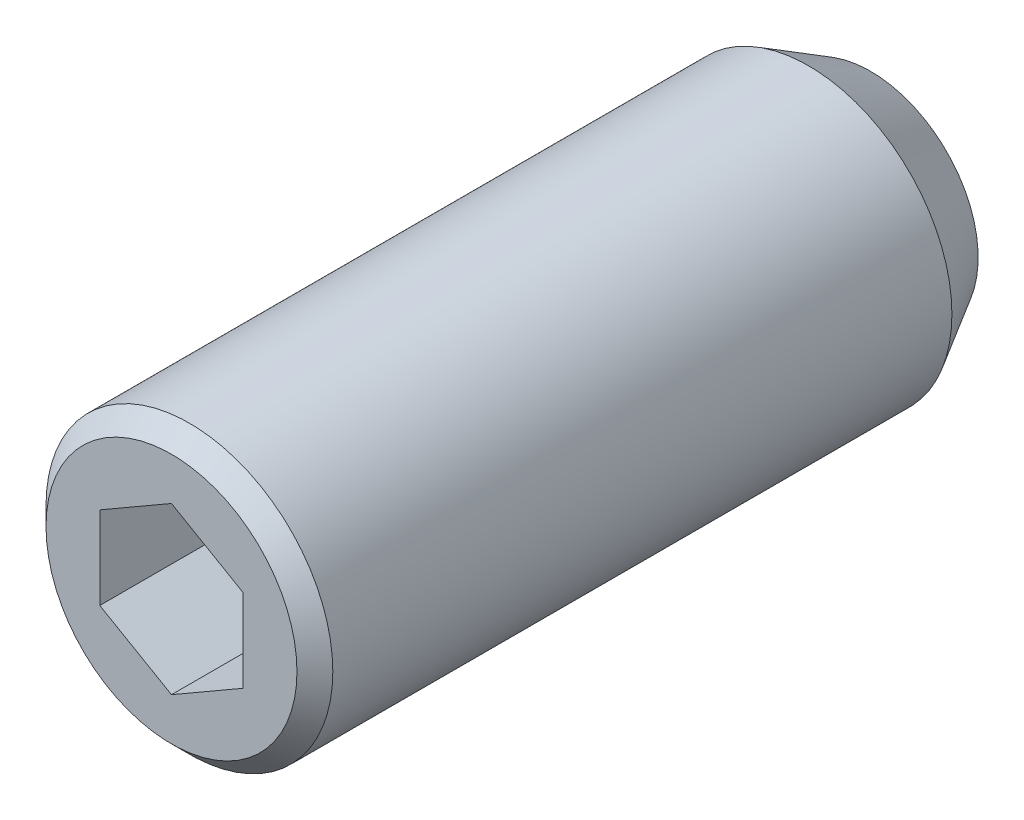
ISO-10303-21;
HEADER;
FILE_DESCRIPTION(('STEP AP214'),'2;1');
FILE_NAME('part.step','',(''),(''),'','','');
FILE_SCHEMA(('AUTOMOTIVE_DESIGN { 1 0 10303 214 1 1 1 1 }'));
ENDSEC;
DATA;
#1=APPLICATION_CONTEXT('core data for automotive mechanical design processes');
#2=APPLICATION_PROTOCOL_DEFINITION('international standard','automotive_design',2000,#1);
#3=PRODUCT_CONTEXT('',#1,'mechanical');
#4=PRODUCT('Part','Part','',(#3));
#5=PRODUCT_RELATED_PRODUCT_CATEGORY('part','',(#4));
#6=PRODUCT_DEFINITION_FORMATION('','',#4);
#7=PRODUCT_DEFINITION_CONTEXT('part definition',#1,'design');
#8=PRODUCT_DEFINITION('design','',#6,#7);
#9=PRODUCT_DEFINITION_SHAPE('','',#8);
#10=(LENGTH_UNIT() NAMED_UNIT(*) SI_UNIT(.MILLI.,.METRE.));
#11=(NAMED_UNIT(*) PLANE_ANGLE_UNIT() SI_UNIT($,.RADIAN.));
#12=(NAMED_UNIT(*) SI_UNIT($,.STERADIAN.) SOLID_ANGLE_UNIT());
#13=UNCERTAINTY_MEASURE_WITH_UNIT(LENGTH_MEASURE(1.E-05),#10,'distance_accuracy_value','');
#14=(GEOMETRIC_REPRESENTATION_CONTEXT(3) GLOBAL_UNCERTAINTY_ASSIGNED_CONTEXT((#13)) GLOBAL_UNIT_ASSIGNED_CONTEXT((#10,
#11,#12)) REPRESENTATION_CONTEXT('',''));
#15=CARTESIAN_POINT('',(0.,0.,0.));
#16=DIRECTION('',(0.,0.,1.));
#17=DIRECTION('',(1.,0.,0.));
#18=AXIS2_PLACEMENT_3D('',#15,#16,#17);
#19=CARTESIAN_POINT('',(1.,0.577350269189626,8.));
#20=DIRECTION('',(0.5,0.866025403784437,0.));
#21=DIRECTION('',(0.866025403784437,-0.5,0.));
#22=AXIS2_PLACEMENT_3D('',#19,#20,#21);
#23=PLANE('',#22);
#24=DIRECTION('',(0.,0.,1.));
#25=VECTOR('',#24,1.);
#26=CARTESIAN_POINT('',(1.,0.577350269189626,8.));
#27=LINE('',#26,#25);
#28=CARTESIAN_POINT('',(1.,0.577350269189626,8.));
#29=VERTEX_POINT('',#28);
#30=CARTESIAN_POINT('',(1.,0.577350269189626,10.));
#31=VERTEX_POINT('',#30);
#32=EDGE_CURVE('E96',#29,#31,#27,.T.);
#33=ORIENTED_EDGE('',*,*,#32,.T.);
#34=DIRECTION('',(-0.866025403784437,0.5,0.));
#35=VECTOR('',#34,1.);
#36=CARTESIAN_POINT('',(1.,0.577350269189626,10.));
#37=LINE('',#36,#35);
#38=CARTESIAN_POINT('',(0.,1.15470053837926,10.));
#39=VERTEX_POINT('',#38);
#40=EDGE_CURVE('E29',#31,#39,#37,.T.);
#41=ORIENTED_EDGE('',*,*,#40,.T.);
#42=DIRECTION('',(0.,0.,1.));
#43=VECTOR('',#42,1.);
#44=CARTESIAN_POINT('',(0.,1.15470053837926,8.));
#45=LINE('',#44,#43);
#46=CARTESIAN_POINT('',(0.,1.15470053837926,8.));
#47=VERTEX_POINT('',#46);
#48=EDGE_CURVE('E34',#47,#39,#45,.T.);
#49=ORIENTED_EDGE('',*,*,#48,.F.);
#50=DIRECTION('',(-0.866025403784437,0.5,0.));
#51=VECTOR('',#50,1.);
#52=CARTESIAN_POINT('',(1.,0.577350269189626,8.));
#53=LINE('',#52,#51);
#54=EDGE_CURVE('E90',#29,#47,#53,.T.);
#55=ORIENTED_EDGE('',*,*,#54,.F.);
#56=EDGE_LOOP('',(#33,#41,#49,#55));
#57=FACE_BOUND('',#56,.T.);
#58=ADVANCED_FACE('F14',(#57),#23,.F.);
#59=CARTESIAN_POINT('',(1.,-0.577350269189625,8.));
#60=DIRECTION('',(1.,0.,0.));
#61=DIRECTION('',(0.,-1.,0.));
#62=AXIS2_PLACEMENT_3D('',#59,#60,#61);
#63=PLANE('',#62);
#64=DIRECTION('',(0.,0.,1.));
#65=VECTOR('',#64,1.);
#66=CARTESIAN_POINT('',(1.,-0.577350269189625,8.));
#67=LINE('',#66,#65);
#68=CARTESIAN_POINT('',(1.,-0.577350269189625,8.));
#69=VERTEX_POINT('',#68);
#70=CARTESIAN_POINT('',(1.,-0.577350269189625,10.));
#71=VERTEX_POINT('',#70);
#72=EDGE_CURVE('E93',#69,#71,#67,.T.);
#73=ORIENTED_EDGE('',*,*,#72,.T.);
#74=DIRECTION('',(0.,1.,0.));
#75=VECTOR('',#74,1.);
#76=CARTESIAN_POINT('',(1.,-0.577350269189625,10.));
#77=LINE('',#76,#75);
#78=EDGE_CURVE('E117',#71,#31,#77,.T.);
#79=ORIENTED_EDGE('',*,*,#78,.T.);
#80=ORIENTED_EDGE('',*,*,#32,.F.);
#81=DIRECTION('',(0.,1.,0.));
#82=VECTOR('',#81,1.);
#83=CARTESIAN_POINT('',(1.,-0.577350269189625,8.));
#84=LINE('',#83,#82);
#85=EDGE_CURVE('E85',#69,#29,#84,.T.);
#86=ORIENTED_EDGE('',*,*,#85,.F.);
#87=EDGE_LOOP('',(#73,#79,#80,#86));
#88=FACE_BOUND('',#87,.T.);
#89=ADVANCED_FACE('F149',(#88),#63,.F.);
#90=CARTESIAN_POINT('',(1.,-0.577350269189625,8.));
#91=DIRECTION('',(-0.5,0.866025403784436,0.));
#92=DIRECTION('',(0.866025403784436,0.5,0.));
#93=AXIS2_PLACEMENT_3D('',#90,#91,#92);
#94=PLANE('',#93);
#95=DIRECTION('',(0.,0.,1.));
#96=VECTOR('',#95,1.);
#97=CARTESIAN_POINT('',(0.,-1.15470053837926,8.));
#98=LINE('',#97,#96);
#99=CARTESIAN_POINT('',(0.,-1.15470053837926,8.));
#100=VERTEX_POINT('',#99);
#101=CARTESIAN_POINT('',(0.,-1.15470053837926,10.));
#102=VERTEX_POINT('',#101);
#103=EDGE_CURVE('E68',#100,#102,#98,.T.);
#104=ORIENTED_EDGE('',*,*,#103,.T.);
#105=DIRECTION('',(-0.866025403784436,-0.5,0.));
#106=VECTOR('',#105,1.);
#107=CARTESIAN_POINT('',(1.,-0.577350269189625,10.));
#108=LINE('',#107,#106);
#109=EDGE_CURVE('E121',#71,#102,#108,.T.);
#110=ORIENTED_EDGE('',*,*,#109,.F.);
#111=ORIENTED_EDGE('',*,*,#72,.F.);
#112=DIRECTION('',(-0.866025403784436,-0.5,0.));
#113=VECTOR('',#112,1.);
#114=CARTESIAN_POINT('',(1.,-0.577350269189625,8.));
#115=LINE('',#114,#113);
#116=EDGE_CURVE('E83',#69,#100,#115,.T.);
#117=ORIENTED_EDGE('',*,*,#116,.T.);
#118=EDGE_LOOP('',(#104,#110,#111,#117));
#119=FACE_BOUND('',#118,.T.);
#120=ADVANCED_FACE('F155',(#119),#94,.T.);
#121=CARTESIAN_POINT('',(-1.,-0.577350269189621,8.));
#122=DIRECTION('',(-0.5,-0.866025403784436,0.));
#123=DIRECTION('',(-0.866025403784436,0.5,0.));
#124=AXIS2_PLACEMENT_3D('',#121,#122,#123);
#125=PLANE('',#124);
#126=DIRECTION('',(0.,0.,1.));
#127=VECTOR('',#126,1.);
#128=CARTESIAN_POINT('',(-1.,-0.577350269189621,8.));
#129=LINE('',#128,#127);
#130=CARTESIAN_POINT('',(-1.,-0.577350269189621,8.));
#131=VERTEX_POINT('',#130);
#132=CARTESIAN_POINT('',(-1.,-0.577350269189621,10.));
#133=VERTEX_POINT('',#132);
#134=EDGE_CURVE('E56',#131,#133,#129,.T.);
#135=ORIENTED_EDGE('',*,*,#134,.T.);
#136=DIRECTION('',(0.866025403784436,-0.5,0.));
#137=VECTOR('',#136,1.);
#138=CARTESIAN_POINT('',(-1.,-0.577350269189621,10.));
#139=LINE('',#138,#137);
#140=EDGE_CURVE('E130',#133,#102,#139,.T.);
#141=ORIENTED_EDGE('',*,*,#140,.T.);
#142=ORIENTED_EDGE('',*,*,#103,.F.);
#143=DIRECTION('',(0.866025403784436,-0.5,0.));
#144=VECTOR('',#143,1.);
#145=CARTESIAN_POINT('',(-1.,-0.577350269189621,8.));
#146=LINE('',#145,#144);
#147=EDGE_CURVE('E76',#131,#100,#146,.T.);
#148=ORIENTED_EDGE('',*,*,#147,.F.);
#149=EDGE_LOOP('',(#135,#141,#142,#148));
#150=FACE_BOUND('',#149,.T.);
#151=ADVANCED_FACE('F81',(#150),#125,.F.);
#152=CARTESIAN_POINT('',(-1.,-0.577350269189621,8.));
#153=DIRECTION('',(1.,0.,0.));
#154=DIRECTION('',(0.,-1.,0.));
#155=AXIS2_PLACEMENT_3D('',#152,#153,#154);
#156=PLANE('',#155);
#157=DIRECTION('',(0.,0.,1.));
#158=VECTOR('',#157,1.);
#159=CARTESIAN_POINT('',(-1.,0.577350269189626,8.));
#160=LINE('',#159,#158);
#161=CARTESIAN_POINT('',(-1.,0.577350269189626,8.));
#162=VERTEX_POINT('',#161);
#163=CARTESIAN_POINT('',(-1.,0.577350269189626,10.));
#164=VERTEX_POINT('',#163);
#165=EDGE_CURVE('E69',#162,#164,#160,.T.);
#166=ORIENTED_EDGE('',*,*,#165,.T.);
#167=DIRECTION('',(0.,1.,0.));
#168=VECTOR('',#167,1.);
#169=CARTESIAN_POINT('',(-1.,-0.577350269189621,10.));
#170=LINE('',#169,#168);
#171=EDGE_CURVE('E63',#133,#164,#170,.T.);
#172=ORIENTED_EDGE('',*,*,#171,.F.);
#173=ORIENTED_EDGE('',*,*,#134,.F.);
#174=DIRECTION('',(0.,1.,0.));
#175=VECTOR('',#174,1.);
#176=CARTESIAN_POINT('',(-1.,-0.577350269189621,8.));
#177=LINE('',#176,#175);
#178=EDGE_CURVE('E60',#131,#162,#177,.T.);
#179=ORIENTED_EDGE('',*,*,#178,.T.);
#180=EDGE_LOOP('',(#166,#172,#173,#179));
#181=FACE_BOUND('',#180,.T.);
#182=ADVANCED_FACE('F59',(#181),#156,.T.);
#183=CARTESIAN_POINT('',(-1.,0.577350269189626,8.));
#184=DIRECTION('',(0.5,-0.866025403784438,0.));
#185=DIRECTION('',(-0.866025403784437,-0.5,0.));
#186=AXIS2_PLACEMENT_3D('',#183,#184,#185);
#187=PLANE('',#186);
#188=DIRECTION('',(0.866025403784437,0.5,0.));
#189=VECTOR('',#188,1.);
#190=CARTESIAN_POINT('',(-1.,0.577350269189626,8.));
#191=LINE('',#190,#189);
#192=EDGE_CURVE('E79',#162,#47,#191,.T.);
#193=ORIENTED_EDGE('',*,*,#192,.T.);
#194=ORIENTED_EDGE('',*,*,#48,.T.);
#195=DIRECTION('',(0.866025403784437,0.5,0.));
#196=VECTOR('',#195,1.);
#197=CARTESIAN_POINT('',(-1.,0.577350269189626,10.));
#198=LINE('',#197,#196);
#199=EDGE_CURVE('E127',#164,#39,#198,.T.);
#200=ORIENTED_EDGE('',*,*,#199,.F.);
#201=ORIENTED_EDGE('',*,*,#165,.F.);
#202=EDGE_LOOP('',(#193,#194,#200,#201));
#203=FACE_BOUND('',#202,.T.);
#204=ADVANCED_FACE('F137',(#203),#187,.T.);
#205=CARTESIAN_POINT('',(2.,0.,8.));
#206=DIRECTION('',(0.,0.,1.));
#207=DIRECTION('',(-1.,0.,0.));
#208=AXIS2_PLACEMENT_3D('',#205,#206,#207);
#209=PLANE('',#208);
#210=ORIENTED_EDGE('',*,*,#54,.T.);
#211=ORIENTED_EDGE('',*,*,#192,.F.);
#212=ORIENTED_EDGE('',*,*,#178,.F.);
#213=ORIENTED_EDGE('',*,*,#147,.T.);
#214=ORIENTED_EDGE('',*,*,#116,.F.);
#215=ORIENTED_EDGE('',*,*,#85,.T.);
#216=EDGE_LOOP('',(#210,#211,#212,#213,#214,#215));
#217=FACE_BOUND('',#216,.T.);
#218=ADVANCED_FACE('F74',(#217),#209,.T.);
#219=CARTESIAN_POINT('',(0.,0.,9.75));
#220=DIRECTION('',(0.,0.,-1.));
#221=DIRECTION('',(1.,0.,0.));
#222=AXIS2_PLACEMENT_3D('',#219,#220,#221);
#223=CYLINDRICAL_SURFACE('',#222,2.);
#224=CARTESIAN_POINT('',(0.,0.,9.75));
#225=DIRECTION('',(0.,0.,-1.));
#226=DIRECTION('',(1.,0.,0.));
#227=AXIS2_PLACEMENT_3D('',#224,#225,#226);
#228=CIRCLE('',#227,2.);
#229=CARTESIAN_POINT('',(2.,0.,9.75));
#230=VERTEX_POINT('',#229);
#231=EDGE_CURVE('E101',#230,#230,#228,.T.);
#232=ORIENTED_EDGE('',*,*,#231,.T.);
#233=EDGE_LOOP('',(#232));
#234=FACE_BOUND('',#233,.T.);
#235=CARTESIAN_POINT('',(0.,0.,1.11602540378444));
#236=DIRECTION('',(0.,0.,-1.));
#237=DIRECTION('',(-1.,0.,0.));
#238=AXIS2_PLACEMENT_3D('',#235,#236,#237);
#239=CIRCLE('',#238,2.);
#240=CARTESIAN_POINT('',(-2.,0.,1.11602540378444));
#241=VERTEX_POINT('',#240);
#242=EDGE_CURVE('E118',#241,#241,#239,.T.);
#243=ORIENTED_EDGE('',*,*,#242,.F.);
#244=EDGE_LOOP('',(#243));
#245=FACE_BOUND('',#244,.T.);
#246=ADVANCED_FACE('F174',(#234,#245),#223,.T.);
#247=CARTESIAN_POINT('',(0.,0.,9.75));
#248=DIRECTION('',(0.,0.,-1.));
#249=DIRECTION('',(1.,0.,0.));
#250=AXIS2_PLACEMENT_3D('',#247,#248,#249);
#251=CONICAL_SURFACE('',#250,2.,0.785398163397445);
#252=CARTESIAN_POINT('',(0.,0.,10.));
#253=DIRECTION('',(0.,0.,-1.));
#254=DIRECTION('',(1.,0.,0.));
#255=AXIS2_PLACEMENT_3D('',#252,#253,#254);
#256=CIRCLE('',#255,1.75);
#257=CARTESIAN_POINT('',(1.75,0.,10.));
#258=VERTEX_POINT('',#257);
#259=EDGE_CURVE('E98',#258,#258,#256,.T.);
#260=ORIENTED_EDGE('',*,*,#259,.T.);
#261=EDGE_LOOP('',(#260));
#262=FACE_BOUND('',#261,.T.);
#263=ORIENTED_EDGE('',*,*,#231,.F.);
#264=EDGE_LOOP('',(#263));
#265=FACE_BOUND('',#264,.T.);
#266=ADVANCED_FACE('F182',(#262,#265),#251,.T.);
#267=CARTESIAN_POINT('',(0.,0.,10.));
#268=DIRECTION('',(0.,0.,-1.));
#269=DIRECTION('',(1.,0.,0.));
#270=AXIS2_PLACEMENT_3D('',#267,#268,#269);
#271=PLANE('',#270);
#272=ORIENTED_EDGE('',*,*,#199,.T.);
#273=ORIENTED_EDGE('',*,*,#40,.F.);
#274=ORIENTED_EDGE('',*,*,#78,.F.);
#275=ORIENTED_EDGE('',*,*,#109,.T.);
#276=ORIENTED_EDGE('',*,*,#140,.F.);
#277=ORIENTED_EDGE('',*,*,#171,.T.);
#278=EDGE_LOOP('',(#272,#273,#274,#275,#276,#277));
#279=FACE_BOUND('',#278,.T.);
#280=ORIENTED_EDGE('',*,*,#259,.F.);
#281=EDGE_LOOP('',(#280));
#282=FACE_BOUND('',#281,.T.);
#283=ADVANCED_FACE('F152',(#279,#282),#271,.F.);
#284=CARTESIAN_POINT('',(0.,0.,0.25));
#285=DIRECTION('',(0.,0.,1.));
#286=DIRECTION('',(1.,0.,0.));
#287=AXIS2_PLACEMENT_3D('',#284,#285,#286);
#288=CONICAL_SURFACE('',#287,1.5,0.523598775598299);
#289=ORIENTED_EDGE('',*,*,#242,.T.);
#290=EDGE_LOOP('',(#289));
#291=FACE_BOUND('',#290,.T.);
#292=CARTESIAN_POINT('',(0.,0.,0.25));
#293=DIRECTION('',(0.,0.,-1.));
#294=DIRECTION('',(-1.,0.,0.));
#295=AXIS2_PLACEMENT_3D('',#292,#293,#294);
#296=CIRCLE('',#295,1.5);
#297=CARTESIAN_POINT('',(-1.5,0.,0.25));
#298=VERTEX_POINT('',#297);
#299=EDGE_CURVE('E115',#298,#298,#296,.T.);
#300=ORIENTED_EDGE('',*,*,#299,.F.);
#301=EDGE_LOOP('',(#300));
#302=FACE_BOUND('',#301,.T.);
#303=ADVANCED_FACE('F196',(#291,#302),#288,.T.);
#304=CARTESIAN_POINT('',(0.,0.,0.));
#305=DIRECTION('',(0.,0.,-1.));
#306=DIRECTION('',(1.,0.,0.));
#307=AXIS2_PLACEMENT_3D('',#304,#305,#306);
#308=PLANE('',#307);
#309=CARTESIAN_POINT('',(0.,0.,0.));
#310=DIRECTION('',(0.,0.,-1.));
#311=DIRECTION('',(1.,0.,0.));
#312=AXIS2_PLACEMENT_3D('',#309,#310,#311);
#313=CIRCLE('',#312,1.);
#314=CARTESIAN_POINT('',(1.,0.,0.));
#315=VERTEX_POINT('',#314);
#316=EDGE_CURVE('E9',#315,#315,#313,.T.);
#317=ORIENTED_EDGE('',*,*,#316,.T.);
#318=EDGE_LOOP('',(#317));
#319=FACE_BOUND('',#318,.T.);
#320=ADVANCED_FACE('F16',(#319),#308,.T.);
#321=CARTESIAN_POINT('',(0.,0.,0.75));
#322=DIRECTION('',(0.,0.,-1.));
#323=DIRECTION('',(1.,0.,0.));
#324=AXIS2_PLACEMENT_3D('',#321,#322,#323);
#325=SPHERICAL_SURFACE('',#324,1.25);
#326=CARTESIAN_POINT('',(0.,0.,0.25));
#327=DIRECTION('',(0.,0.,-1.));
#328=DIRECTION('',(1.,0.,0.));
#329=AXIS2_PLACEMENT_3D('',#326,#327,#328);
#330=CIRCLE('',#329,1.14564392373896);
#331=CARTESIAN_POINT('',(1.14564392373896,0.,0.25));
#332=VERTEX_POINT('',#331);
#333=EDGE_CURVE('E22',#332,#332,#330,.T.);
#334=CARTESIAN_POINT('',(1.14564392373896,0.,0.25));
#335=CARTESIAN_POINT('',(1.14443567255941,0.,0.247231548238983));
#336=CARTESIAN_POINT('',(1.14321738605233,0.,0.244467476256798));
#337=CARTESIAN_POINT('',(1.14076080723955,0.,0.238948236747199));
#338=CARTESIAN_POINT('',(1.13952251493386,0.,0.236193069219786));
#339=CARTESIAN_POINT('',(1.13702598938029,0.,0.230691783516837));
#340=CARTESIAN_POINT('',(1.13576775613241,0.,0.227945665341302));
#341=CARTESIAN_POINT('',(1.13323141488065,0.,0.222462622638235));
#342=CARTESIAN_POINT('',(1.13195330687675,0.,0.219725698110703));
#343=CARTESIAN_POINT('',(1.12937728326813,0.,0.21426118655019));
#344=CARTESIAN_POINT('',(1.12807936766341,0.,0.21153359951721));
#345=CARTESIAN_POINT('',(1.12546379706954,0.,0.206087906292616));
#346=CARTESIAN_POINT('',(1.1241461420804,0.,0.203369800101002));
#347=CARTESIAN_POINT('',(1.12149116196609,0.,0.197943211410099));
#348=CARTESIAN_POINT('',(1.12015383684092,0.,0.195234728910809));
#349=CARTESIAN_POINT('',(1.11745958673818,0.,0.189827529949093));
#350=CARTESIAN_POINT('',(1.11610266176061,0.,0.187128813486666));
#351=CARTESIAN_POINT('',(1.11336928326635,0.,0.18174128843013));
#352=CARTESIAN_POINT('',(1.11199282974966,0.,0.179052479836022));
#353=CARTESIAN_POINT('',(1.10922046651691,0.,0.173684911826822));
#354=CARTESIAN_POINT('',(1.10782455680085,0.,0.171006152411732));
#355=CARTESIAN_POINT('',(1.10501335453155,0.,0.165658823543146));
#356=CARTESIAN_POINT('',(1.10359806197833,0.,0.16299025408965));
#357=CARTESIAN_POINT('',(1.10074816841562,0.,0.157663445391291));
#358=CARTESIAN_POINT('',(1.09931356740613,0.,0.155005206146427));
#359=CARTESIAN_POINT('',(1.09642513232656,0.,0.149699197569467));
#360=CARTESIAN_POINT('',(1.09497129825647,0.,0.14705142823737));
#361=CARTESIAN_POINT('',(1.09204447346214,0.,0.141766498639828));
#362=CARTESIAN_POINT('',(1.0905714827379,0.,0.139129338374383));
#363=CARTESIAN_POINT('',(1.08760642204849,0.,0.133865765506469));
#364=CARTESIAN_POINT('',(1.08611435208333,0.,0.131239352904));
#365=CARTESIAN_POINT('',(1.08311121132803,0.,0.125997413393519));
#366=CARTESIAN_POINT('',(1.0816001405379,0.,0.123381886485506));
#367=CARTESIAN_POINT('',(1.07855907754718,0.,0.118161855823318));
#368=CARTESIAN_POINT('',(1.0770290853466,0.,0.115557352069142));
#369=CARTESIAN_POINT('',(1.07395025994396,0.,0.110359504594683));
#370=CARTESIAN_POINT('',(1.07240142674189,0.,0.107766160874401));
#371=CARTESIAN_POINT('',(1.06928500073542,0.,0.102590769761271));
#372=CARTESIAN_POINT('',(1.06771740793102,0.,0.100008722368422));
#373=CARTESIAN_POINT('',(1.06456354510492,0.,0.0948560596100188));
#374=CARTESIAN_POINT('',(1.06297727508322,0.,0.0922854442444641));
#375=CARTESIAN_POINT('',(1.0597861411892,0.,0.0871557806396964));
#376=CARTESIAN_POINT('',(1.05818127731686,0.,0.0845967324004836));
#377=CARTESIAN_POINT('',(1.05495304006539,0.,0.0794903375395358));
#378=CARTESIAN_POINT('',(1.05332966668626,0.,0.0769429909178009));
#379=CARTESIAN_POINT('',(1.0500644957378,0.,0.071860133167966));
#380=CARTESIAN_POINT('',(1.04842269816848,0.,0.069324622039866));
#381=CARTESIAN_POINT('',(1.04512076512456,0.,0.0642655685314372));
#382=CARTESIAN_POINT('',(1.04346062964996,0.,0.0617420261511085));
#383=CARTESIAN_POINT('',(1.04012210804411,0.,0.0567070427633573));
#384=CARTESIAN_POINT('',(1.03844372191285,0.,0.0541956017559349));
#385=CARTESIAN_POINT('',(1.03506878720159,0.,0.0491849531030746));
#386=CARTESIAN_POINT('',(1.03337223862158,0.,0.0466857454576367));
#387=CARTESIAN_POINT('',(1.02996106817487,0.,0.0416996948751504));
#388=CARTESIAN_POINT('',(1.02824644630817,0.,0.039212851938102));
#389=CARTESIAN_POINT('',(1.02479921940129,0.,0.0342516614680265));
#390=CARTESIAN_POINT('',(1.02306661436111,0.,0.0317773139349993));
#391=CARTESIAN_POINT('',(1.01958351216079,0.,0.0268412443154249));
#392=CARTESIAN_POINT('',(1.01783301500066,0.,0.0243795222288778));
#393=CARTESIAN_POINT('',(1.01431422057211,0.,0.019468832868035));
#394=CARTESIAN_POINT('',(1.01254592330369,0.,0.0170198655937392));
#395=CARTESIAN_POINT('',(1.00899162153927,0.,0.012134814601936));
#396=CARTESIAN_POINT('',(1.00720561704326,0.,0.00969873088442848));
#397=CARTESIAN_POINT('',(1.00361599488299,0.,0.00483957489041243));
#398=CARTESIAN_POINT('',(1.00181237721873,0.,0.00241650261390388));
#399=CARTESIAN_POINT('',(1.,0.,0.));
#400=B_SPLINE_CURVE_WITH_KNOTS('',3,(#334,#335,#336,#337,#338,#339,#340,#341,#342,#343,#344,
#345,#346,#347,#348,#349,#350,#351,#352,#353,#354,#355,#356,#357,#358,#359,#360,#361,#362,#363,
#364,#365,#366,#367,#368,#369,#370,#371,#372,#373,#374,#375,#376,#377,#378,#379,#380,#381,#382,
#383,#384,#385,#386,#387,#388,#389,#390,#391,#392,#393,#394,#395,#396,#397,#398,#399),
.UNSPECIFIED.,.F.,.F.,(4,2,2,2,2,2,2,2,2,2,2,2,2,2,2,2,2,2,2,2,2,2,2,2,2,2,2,2,2,2,2,2,4),(0.,
0.00906186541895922,0.0181237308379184,0.0271855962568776,0.0362474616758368,0.045309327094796,
0.0543711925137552,0.0634330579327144,0.0724949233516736,0.0815567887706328,0.0906186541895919,
0.0996805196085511,0.10874238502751,0.11780425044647,0.126866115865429,0.135927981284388,
0.144989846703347,0.154051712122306,0.163113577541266,0.172175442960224,0.181237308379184,
0.190299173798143,0.199361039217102,0.208422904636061,0.21748477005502,0.22654663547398,
0.235608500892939,0.244670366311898,0.253732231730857,0.262794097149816,0.271855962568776,
0.280917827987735,0.289979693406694),.UNSPECIFIED.);
#401=EDGE_CURVE('BSEAM106',#332,#315,#400,.T.);
#402=ORIENTED_EDGE('',*,*,#333,.T.);
#403=ORIENTED_EDGE('',*,*,#316,.F.);
#404=ORIENTED_EDGE('',*,*,#401,.T.);
#405=ORIENTED_EDGE('',*,*,#401,.F.);
#406=EDGE_LOOP('',(#402,#404,#403,#405));
#407=FACE_BOUND('',#406,.T.);
#408=ADVANCED_FACE('F106',(#407),#325,.T.);
#409=CARTESIAN_POINT('',(1.42264973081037,0.,0.25));
#410=DIRECTION('',(0.,0.,1.));
#411=DIRECTION('',(-1.,0.,0.));
#412=AXIS2_PLACEMENT_3D('',#409,#410,#411);
#413=PLANE('',#412);
#414=ORIENTED_EDGE('',*,*,#333,.F.);
#415=EDGE_LOOP('',(#414));
#416=FACE_BOUND('',#415,.T.);
#417=ORIENTED_EDGE('',*,*,#299,.T.);
#418=EDGE_LOOP('',(#417));
#419=FACE_BOUND('',#418,.T.);
#420=ADVANCED_FACE('F109',(#416,#419),#413,.F.);
#421=CLOSED_SHELL('',(#58,#89,#120,#151,#182,#204,#218,#246,#266,#283,#303,#320,#408,#420));
#422=MANIFOLD_SOLID_BREP('B1',#421);
#423=ADVANCED_BREP_SHAPE_REPRESENTATION('',(#18,#422),#14);
#424=SHAPE_DEFINITION_REPRESENTATION(#9,#423);
ENDSEC;
END-ISO-10303-21;
